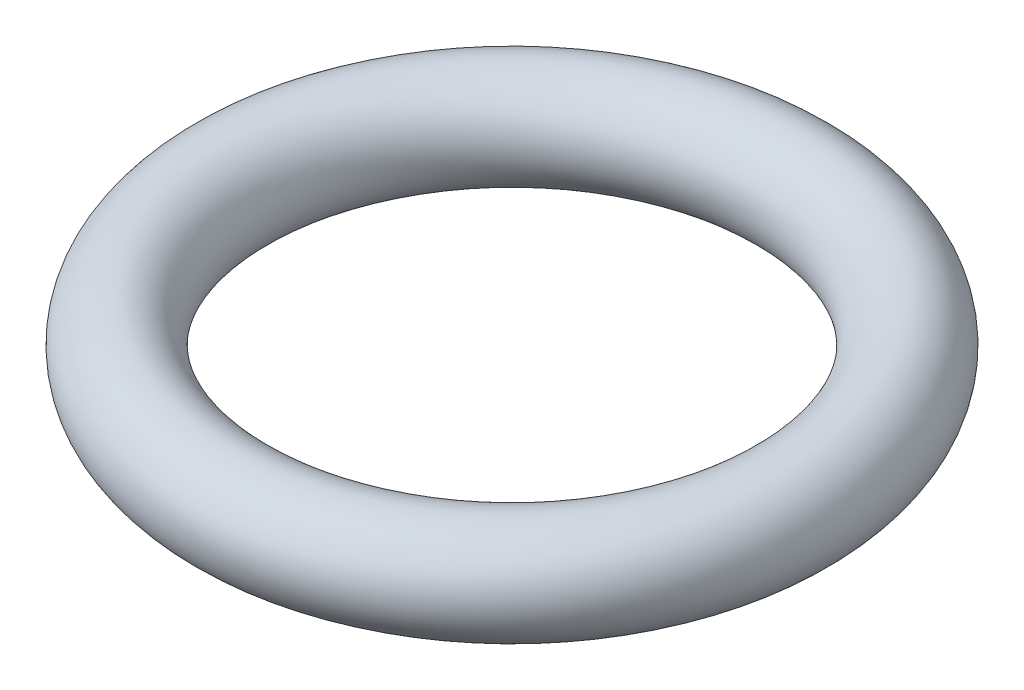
from build123d import *

# Parameters (mm, degrees)
ESQUISSE1_R = 1.5


with BuildPart() as part:
    # Esquisse1 → Base-R_volution (revolve)
    with BuildSketch(Plane.XY, mode=Mode.PRIVATE) as base_r_volution_sk:
        with Locations((8.4, 0)):
            Circle(ESQUISSE1_R)
    revolve(base_r_volution_sk.sketch.rotate(Axis((0, 0, 0), (0, 1, 0)), 90), axis=Axis((0, 0, 0), (0, 1, 0)))


solid = part.part
